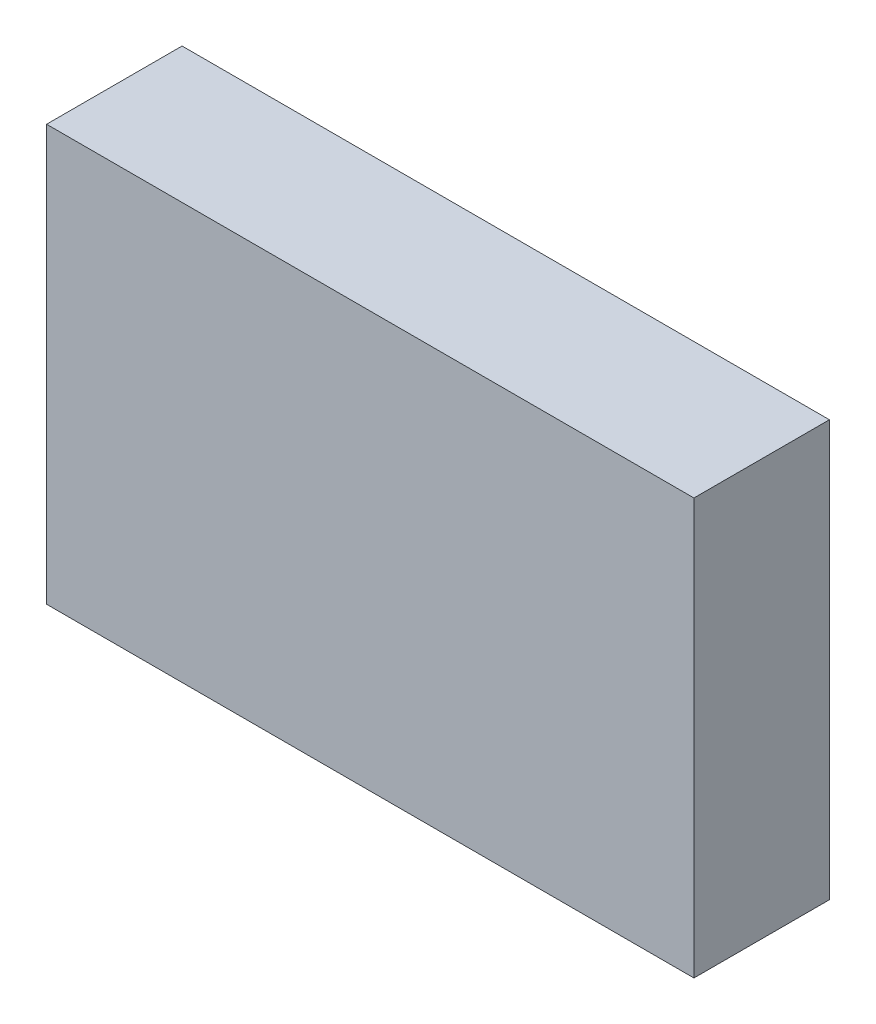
ISO-10303-21;
HEADER;
FILE_DESCRIPTION(('STEP AP214'),'2;1');
FILE_NAME('part.step','',(''),(''),'','','');
FILE_SCHEMA(('AUTOMOTIVE_DESIGN { 1 0 10303 214 1 1 1 1 }'));
ENDSEC;
DATA;
#1=APPLICATION_CONTEXT('core data for automotive mechanical design processes');
#2=APPLICATION_PROTOCOL_DEFINITION('international standard','automotive_design',2000,#1);
#3=PRODUCT_CONTEXT('',#1,'mechanical');
#4=PRODUCT('Part','Part','',(#3));
#5=PRODUCT_RELATED_PRODUCT_CATEGORY('part','',(#4));
#6=PRODUCT_DEFINITION_FORMATION('','',#4);
#7=PRODUCT_DEFINITION_CONTEXT('part definition',#1,'design');
#8=PRODUCT_DEFINITION('design','',#6,#7);
#9=PRODUCT_DEFINITION_SHAPE('','',#8);
#10=(LENGTH_UNIT() NAMED_UNIT(*) SI_UNIT(.MILLI.,.METRE.));
#11=(NAMED_UNIT(*) PLANE_ANGLE_UNIT() SI_UNIT($,.RADIAN.));
#12=(NAMED_UNIT(*) SI_UNIT($,.STERADIAN.) SOLID_ANGLE_UNIT());
#13=UNCERTAINTY_MEASURE_WITH_UNIT(LENGTH_MEASURE(1.E-05),#10,'distance_accuracy_value','');
#14=(GEOMETRIC_REPRESENTATION_CONTEXT(3) GLOBAL_UNCERTAINTY_ASSIGNED_CONTEXT((#13)) GLOBAL_UNIT_ASSIGNED_CONTEXT((#10,
#11,#12)) REPRESENTATION_CONTEXT('',''));
#15=CARTESIAN_POINT('',(0.,0.,0.));
#16=DIRECTION('',(0.,0.,1.));
#17=DIRECTION('',(1.,0.,0.));
#18=AXIS2_PLACEMENT_3D('',#15,#16,#17);
#19=CARTESIAN_POINT('',(23.8891463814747,-16.2183195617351,10.));
#20=DIRECTION('',(-1.,0.,0.));
#21=DIRECTION('',(0.,0.,1.));
#22=AXIS2_PLACEMENT_3D('',#19,#20,#21);
#23=PLANE('',#22);
#24=DIRECTION('',(0.,1.,0.));
#25=VECTOR('',#24,1.);
#26=CARTESIAN_POINT('',(23.8891463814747,-16.2183195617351,0.));
#27=LINE('',#26,#25);
#28=CARTESIAN_POINT('',(23.8891463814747,-16.2183195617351,0.));
#29=VERTEX_POINT('',#28);
#30=CARTESIAN_POINT('',(23.8891463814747,14.4649877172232,0.));
#31=VERTEX_POINT('',#30);
#32=EDGE_CURVE('E96',#29,#31,#27,.T.);
#33=ORIENTED_EDGE('',*,*,#32,.T.);
#34=DIRECTION('',(0.,0.,-1.));
#35=VECTOR('',#34,1.);
#36=CARTESIAN_POINT('',(23.8891463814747,14.4649877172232,10.));
#37=LINE('',#36,#35);
#38=CARTESIAN_POINT('',(23.8891463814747,14.4649877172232,10.));
#39=VERTEX_POINT('',#38);
#40=EDGE_CURVE('E11',#39,#31,#37,.T.);
#41=ORIENTED_EDGE('',*,*,#40,.F.);
#42=DIRECTION('',(0.,1.,0.));
#43=VECTOR('',#42,1.);
#44=CARTESIAN_POINT('',(23.8891463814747,-16.2183195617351,10.));
#45=LINE('',#44,#43);
#46=CARTESIAN_POINT('',(23.8891463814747,-16.2183195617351,10.));
#47=VERTEX_POINT('',#46);
#48=EDGE_CURVE('E84',#47,#39,#45,.T.);
#49=ORIENTED_EDGE('',*,*,#48,.F.);
#50=DIRECTION('',(0.,0.,-1.));
#51=VECTOR('',#50,1.);
#52=CARTESIAN_POINT('',(23.8891463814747,-16.2183195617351,10.));
#53=LINE('',#52,#51);
#54=EDGE_CURVE('E92',#47,#29,#53,.T.);
#55=ORIENTED_EDGE('',*,*,#54,.T.);
#56=EDGE_LOOP('',(#33,#41,#49,#55));
#57=FACE_BOUND('',#56,.T.);
#58=ADVANCED_FACE('F33',(#57),#23,.F.);
#59=CARTESIAN_POINT('',(-23.8891463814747,14.4649877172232,10.));
#60=DIRECTION('',(0.,-1.,0.));
#61=DIRECTION('',(0.,0.,-1.));
#62=AXIS2_PLACEMENT_3D('',#59,#60,#61);
#63=PLANE('',#62);
#64=DIRECTION('',(-1.,0.,0.));
#65=VECTOR('',#64,1.);
#66=CARTESIAN_POINT('',(-23.8891463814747,14.4649877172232,0.));
#67=LINE('',#66,#65);
#68=CARTESIAN_POINT('',(-23.8891463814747,14.4649877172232,0.));
#69=VERTEX_POINT('',#68);
#70=EDGE_CURVE('E88',#31,#69,#67,.T.);
#71=ORIENTED_EDGE('',*,*,#70,.T.);
#72=DIRECTION('',(0.,0.,-1.));
#73=VECTOR('',#72,1.);
#74=CARTESIAN_POINT('',(-23.8891463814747,14.4649877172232,10.));
#75=LINE('',#74,#73);
#76=CARTESIAN_POINT('',(-23.8891463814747,14.4649877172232,10.));
#77=VERTEX_POINT('',#76);
#78=EDGE_CURVE('E41',#77,#69,#75,.T.);
#79=ORIENTED_EDGE('',*,*,#78,.F.);
#80=DIRECTION('',(-1.,0.,0.));
#81=VECTOR('',#80,1.);
#82=CARTESIAN_POINT('',(-23.8891463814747,14.4649877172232,10.));
#83=LINE('',#82,#81);
#84=EDGE_CURVE('E79',#39,#77,#83,.T.);
#85=ORIENTED_EDGE('',*,*,#84,.F.);
#86=ORIENTED_EDGE('',*,*,#40,.T.);
#87=EDGE_LOOP('',(#71,#79,#85,#86));
#88=FACE_BOUND('',#87,.T.);
#89=ADVANCED_FACE('F87',(#88),#63,.F.);
#90=CARTESIAN_POINT('',(-23.8891463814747,-16.2183195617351,10.));
#91=DIRECTION('',(1.,0.,0.));
#92=DIRECTION('',(0.,0.,-1.));
#93=AXIS2_PLACEMENT_3D('',#90,#91,#92);
#94=PLANE('',#93);
#95=DIRECTION('',(0.,-1.,0.));
#96=VECTOR('',#95,1.);
#97=CARTESIAN_POINT('',(-23.8891463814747,-16.2183195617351,0.));
#98=LINE('',#97,#96);
#99=CARTESIAN_POINT('',(-23.8891463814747,-16.2183195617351,0.));
#100=VERTEX_POINT('',#99);
#101=EDGE_CURVE('E66',#69,#100,#98,.T.);
#102=ORIENTED_EDGE('',*,*,#101,.T.);
#103=DIRECTION('',(0.,0.,-1.));
#104=VECTOR('',#103,1.);
#105=CARTESIAN_POINT('',(-23.8891463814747,-16.2183195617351,10.));
#106=LINE('',#105,#104);
#107=CARTESIAN_POINT('',(-23.8891463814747,-16.2183195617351,10.));
#108=VERTEX_POINT('',#107);
#109=EDGE_CURVE('E89',#108,#100,#106,.T.);
#110=ORIENTED_EDGE('',*,*,#109,.F.);
#111=DIRECTION('',(0.,-1.,0.));
#112=VECTOR('',#111,1.);
#113=CARTESIAN_POINT('',(-23.8891463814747,-16.2183195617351,10.));
#114=LINE('',#113,#112);
#115=EDGE_CURVE('E82',#77,#108,#114,.T.);
#116=ORIENTED_EDGE('',*,*,#115,.F.);
#117=ORIENTED_EDGE('',*,*,#78,.T.);
#118=EDGE_LOOP('',(#102,#110,#116,#117));
#119=FACE_BOUND('',#118,.T.);
#120=ADVANCED_FACE('F90',(#119),#94,.F.);
#121=CARTESIAN_POINT('',(-23.8891463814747,-16.2183195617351,10.));
#122=DIRECTION('',(0.,1.,0.));
#123=DIRECTION('',(0.,0.,1.));
#124=AXIS2_PLACEMENT_3D('',#121,#122,#123);
#125=PLANE('',#124);
#126=DIRECTION('',(1.,0.,0.));
#127=VECTOR('',#126,1.);
#128=CARTESIAN_POINT('',(-23.8891463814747,-16.2183195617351,0.));
#129=LINE('',#128,#127);
#130=EDGE_CURVE('E72',#100,#29,#129,.T.);
#131=ORIENTED_EDGE('',*,*,#130,.T.);
#132=ORIENTED_EDGE('',*,*,#54,.F.);
#133=DIRECTION('',(1.,0.,0.));
#134=VECTOR('',#133,1.);
#135=CARTESIAN_POINT('',(-23.8891463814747,-16.2183195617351,10.));
#136=LINE('',#135,#134);
#137=EDGE_CURVE('E49',#108,#47,#136,.T.);
#138=ORIENTED_EDGE('',*,*,#137,.F.);
#139=ORIENTED_EDGE('',*,*,#109,.T.);
#140=EDGE_LOOP('',(#131,#132,#138,#139));
#141=FACE_BOUND('',#140,.T.);
#142=ADVANCED_FACE('F103',(#141),#125,.F.);
#143=CARTESIAN_POINT('',(0.,0.,10.));
#144=DIRECTION('',(0.,0.,-1.));
#145=DIRECTION('',(-1.,0.,0.));
#146=AXIS2_PLACEMENT_3D('',#143,#144,#145);
#147=PLANE('',#146);
#148=ORIENTED_EDGE('',*,*,#48,.T.);
#149=ORIENTED_EDGE('',*,*,#84,.T.);
#150=ORIENTED_EDGE('',*,*,#115,.T.);
#151=ORIENTED_EDGE('',*,*,#137,.T.);
#152=EDGE_LOOP('',(#148,#149,#150,#151));
#153=FACE_BOUND('',#152,.T.);
#154=ADVANCED_FACE('F80',(#153),#147,.F.);
#155=CARTESIAN_POINT('',(0.,0.,0.));
#156=DIRECTION('',(0.,0.,-1.));
#157=DIRECTION('',(-1.,0.,0.));
#158=AXIS2_PLACEMENT_3D('',#155,#156,#157);
#159=PLANE('',#158);
#160=ORIENTED_EDGE('',*,*,#32,.F.);
#161=ORIENTED_EDGE('',*,*,#130,.F.);
#162=ORIENTED_EDGE('',*,*,#101,.F.);
#163=ORIENTED_EDGE('',*,*,#70,.F.);
#164=EDGE_LOOP('',(#160,#161,#162,#163));
#165=FACE_BOUND('',#164,.T.);
#166=ADVANCED_FACE('F106',(#165),#159,.T.);
#167=CLOSED_SHELL('',(#58,#89,#120,#142,#154,#166));
#168=MANIFOLD_SOLID_BREP('B2',#167);
#169=ADVANCED_BREP_SHAPE_REPRESENTATION('',(#18,#168),#14);
#170=SHAPE_DEFINITION_REPRESENTATION(#9,#169);
ENDSEC;
END-ISO-10303-21;
